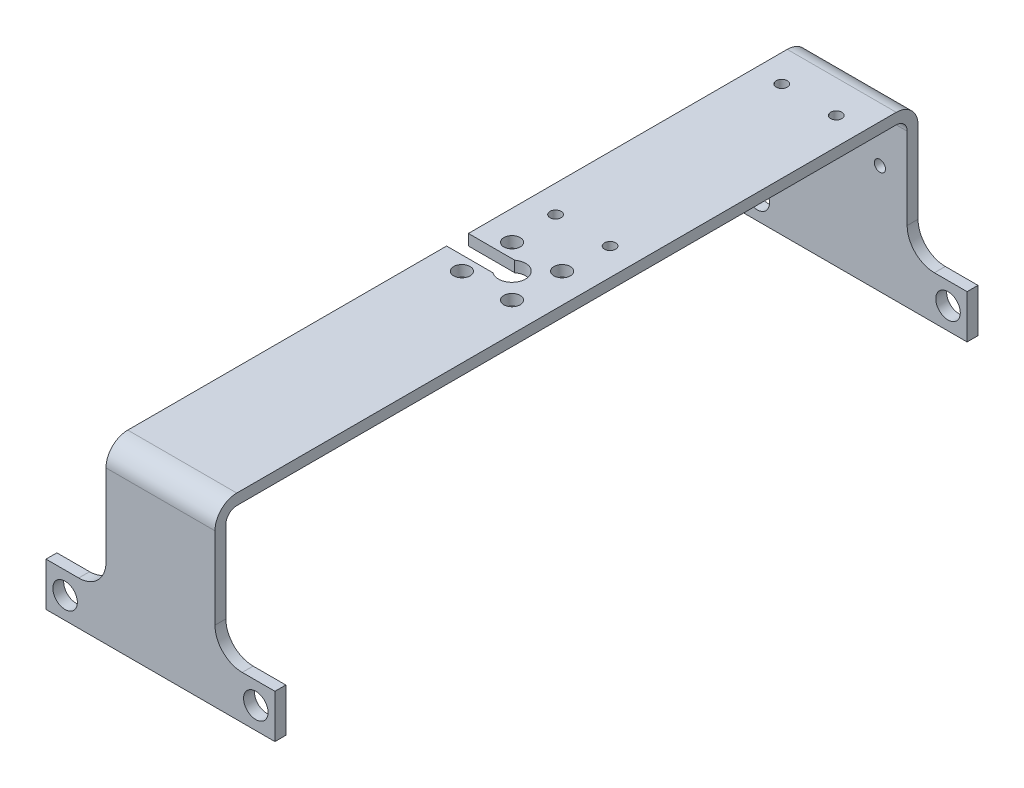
ISO-10303-21;
HEADER;
FILE_DESCRIPTION(('STEP AP214'),'2;1');
FILE_NAME('part.step','',(''),(''),'','','');
FILE_SCHEMA(('AUTOMOTIVE_DESIGN { 1 0 10303 214 1 1 1 1 }'));
ENDSEC;
DATA;
#1=APPLICATION_CONTEXT('core data for automotive mechanical design processes');
#2=APPLICATION_PROTOCOL_DEFINITION('international standard','automotive_design',2000,#1);
#3=PRODUCT_CONTEXT('',#1,'mechanical');
#4=PRODUCT('Part','Part','',(#3));
#5=PRODUCT_RELATED_PRODUCT_CATEGORY('part','',(#4));
#6=PRODUCT_DEFINITION_FORMATION('','',#4);
#7=PRODUCT_DEFINITION_CONTEXT('part definition',#1,'design');
#8=PRODUCT_DEFINITION('design','',#6,#7);
#9=PRODUCT_DEFINITION_SHAPE('','',#8);
#10=(LENGTH_UNIT() NAMED_UNIT(*) SI_UNIT(.MILLI.,.METRE.));
#11=(NAMED_UNIT(*) PLANE_ANGLE_UNIT() SI_UNIT($,.RADIAN.));
#12=(NAMED_UNIT(*) SI_UNIT($,.STERADIAN.) SOLID_ANGLE_UNIT());
#13=UNCERTAINTY_MEASURE_WITH_UNIT(LENGTH_MEASURE(1.E-05),#10,'distance_accuracy_value','');
#14=(GEOMETRIC_REPRESENTATION_CONTEXT(3) GLOBAL_UNCERTAINTY_ASSIGNED_CONTEXT((#13)) GLOBAL_UNIT_ASSIGNED_CONTEXT((#10,
#11,#12)) REPRESENTATION_CONTEXT('',''));
#15=CARTESIAN_POINT('',(0.,0.,0.));
#16=DIRECTION('',(0.,0.,1.));
#17=DIRECTION('',(1.,0.,0.));
#18=AXIS2_PLACEMENT_3D('',#15,#16,#17);
#19=CARTESIAN_POINT('',(20.,28.,3.99999999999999));
#20=DIRECTION('',(1.,0.,0.));
#21=DIRECTION('',(0.,0.,-1.));
#22=AXIS2_PLACEMENT_3D('',#19,#20,#21);
#23=PLANE('',#22);
#24=DIRECTION('',(0.,1.,0.));
#25=VECTOR('',#24,1.);
#26=CARTESIAN_POINT('',(20.,28.,129.));
#27=LINE('',#26,#25);
#28=CARTESIAN_POINT('',(20.,13.,129.));
#29=VERTEX_POINT('',#28);
#30=CARTESIAN_POINT('',(20.,28.,129.));
#31=VERTEX_POINT('',#30);
#32=EDGE_CURVE('E331',#29,#31,#27,.T.);
#33=ORIENTED_EDGE('',*,*,#32,.F.);
#34=DIRECTION('',(0.,0.,1.));
#35=VECTOR('',#34,1.);
#36=CARTESIAN_POINT('',(20.,13.,127.));
#37=LINE('',#36,#35);
#38=CARTESIAN_POINT('',(20.,13.,127.));
#39=VERTEX_POINT('',#38);
#40=EDGE_CURVE('E442',#29,#39,#37,.F.);
#41=ORIENTED_EDGE('',*,*,#40,.T.);
#42=DIRECTION('',(0.,-1.,0.));
#43=VECTOR('',#42,1.);
#44=CARTESIAN_POINT('',(20.,0.,127.));
#45=LINE('',#44,#43);
#46=CARTESIAN_POINT('',(20.,28.,127.));
#47=VERTEX_POINT('',#46);
#48=EDGE_CURVE('E235',#47,#39,#45,.T.);
#49=ORIENTED_EDGE('',*,*,#48,.F.);
#50=CARTESIAN_POINT('',(20.,28.,125.));
#51=DIRECTION('',(1.,0.,0.));
#52=DIRECTION('',(0.,0.,-1.));
#53=AXIS2_PLACEMENT_3D('',#50,#51,#52);
#54=CIRCLE('',#53,1.99999999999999);
#55=CARTESIAN_POINT('',(20.,30.,125.));
#56=VERTEX_POINT('',#55);
#57=EDGE_CURVE('E336',#56,#47,#54,.T.);
#58=ORIENTED_EDGE('',*,*,#57,.F.);
#59=DIRECTION('',(0.,0.,-1.));
#60=VECTOR('',#59,1.);
#61=CARTESIAN_POINT('',(20.,30.,71.5));
#62=LINE('',#61,#60);
#63=CARTESIAN_POINT('',(20.,30.,3.99999999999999));
#64=VERTEX_POINT('',#63);
#65=EDGE_CURVE('E414',#56,#64,#62,.T.);
#66=ORIENTED_EDGE('',*,*,#65,.T.);
#67=CARTESIAN_POINT('',(20.,28.,3.99999999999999));
#68=DIRECTION('',(-1.,0.,0.));
#69=DIRECTION('',(0.,0.,-1.));
#70=AXIS2_PLACEMENT_3D('',#67,#68,#69);
#71=CIRCLE('',#70,1.99999999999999);
#72=CARTESIAN_POINT('',(20.,28.,2.));
#73=VERTEX_POINT('',#72);
#74=EDGE_CURVE('E416',#64,#73,#71,.T.);
#75=ORIENTED_EDGE('',*,*,#74,.T.);
#76=DIRECTION('',(0.,-1.,0.));
#77=VECTOR('',#76,1.);
#78=CARTESIAN_POINT('',(20.,0.,2.));
#79=LINE('',#78,#77);
#80=CARTESIAN_POINT('',(20.,13.,2.));
#81=VERTEX_POINT('',#80);
#82=EDGE_CURVE('E419',#73,#81,#79,.T.);
#83=ORIENTED_EDGE('',*,*,#82,.T.);
#84=DIRECTION('',(0.,0.,-1.));
#85=VECTOR('',#84,1.);
#86=CARTESIAN_POINT('',(20.,13.,3.99999999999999));
#87=LINE('',#86,#85);
#88=CARTESIAN_POINT('',(20.,13.,0.));
#89=VERTEX_POINT('',#88);
#90=EDGE_CURVE('E474',#81,#89,#87,.T.);
#91=ORIENTED_EDGE('',*,*,#90,.T.);
#92=DIRECTION('',(0.,1.,0.));
#93=VECTOR('',#92,1.);
#94=CARTESIAN_POINT('',(20.,28.,0.));
#95=LINE('',#94,#93);
#96=CARTESIAN_POINT('',(20.,28.,0.));
#97=VERTEX_POINT('',#96);
#98=EDGE_CURVE('E428',#89,#97,#95,.T.);
#99=ORIENTED_EDGE('',*,*,#98,.T.);
#100=CARTESIAN_POINT('',(20.,28.,4.));
#101=DIRECTION('',(1.,0.,0.));
#102=DIRECTION('',(0.,0.,-1.));
#103=AXIS2_PLACEMENT_3D('',#100,#101,#102);
#104=CIRCLE('',#103,4.);
#105=CARTESIAN_POINT('',(20.,32.,4.));
#106=VERTEX_POINT('',#105);
#107=EDGE_CURVE('E484',#97,#106,#104,.T.);
#108=ORIENTED_EDGE('',*,*,#107,.T.);
#109=DIRECTION('',(0.,0.,1.));
#110=VECTOR('',#109,1.);
#111=CARTESIAN_POINT('',(20.,32.,4.));
#112=LINE('',#111,#110);
#113=CARTESIAN_POINT('',(20.,32.,125.));
#114=VERTEX_POINT('',#113);
#115=EDGE_CURVE('E515',#106,#114,#112,.T.);
#116=ORIENTED_EDGE('',*,*,#115,.T.);
#117=CARTESIAN_POINT('',(20.,28.,125.));
#118=DIRECTION('',(1.,0.,0.));
#119=DIRECTION('',(0.,0.,-1.));
#120=AXIS2_PLACEMENT_3D('',#117,#118,#119);
#121=CIRCLE('',#120,4.);
#122=EDGE_CURVE('E326',#31,#114,#121,.F.);
#123=ORIENTED_EDGE('',*,*,#122,.F.);
#124=EDGE_LOOP('',(#33,#41,#49,#58,#66,#75,#83,#91,#99,#108,#116,#123));
#125=FACE_BOUND('',#124,.T.);
#126=ADVANCED_FACE('F39',(#125),#23,.T.);
#127=CARTESIAN_POINT('',(0.,28.,3.99999999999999));
#128=DIRECTION('',(1.,0.,0.));
#129=DIRECTION('',(0.,0.,-1.));
#130=AXIS2_PLACEMENT_3D('',#127,#128,#129);
#131=PLANE('',#130);
#132=DIRECTION('',(0.,1.,0.));
#133=VECTOR('',#132,1.);
#134=CARTESIAN_POINT('',(0.,28.,0.));
#135=LINE('',#134,#133);
#136=CARTESIAN_POINT('',(0.,13.,0.));
#137=VERTEX_POINT('',#136);
#138=CARTESIAN_POINT('',(0.,28.,0.));
#139=VERTEX_POINT('',#138);
#140=EDGE_CURVE('E521',#137,#139,#135,.T.);
#141=ORIENTED_EDGE('',*,*,#140,.F.);
#142=DIRECTION('',(0.,0.,-1.));
#143=VECTOR('',#142,1.);
#144=CARTESIAN_POINT('',(0.,13.,2.));
#145=LINE('',#144,#143);
#146=CARTESIAN_POINT('',(0.,13.,2.));
#147=VERTEX_POINT('',#146);
#148=EDGE_CURVE('E60',#137,#147,#145,.F.);
#149=ORIENTED_EDGE('',*,*,#148,.T.);
#150=DIRECTION('',(0.,-1.,0.));
#151=VECTOR('',#150,1.);
#152=CARTESIAN_POINT('',(0.,0.,2.));
#153=LINE('',#152,#151);
#154=CARTESIAN_POINT('',(0.,28.,2.));
#155=VERTEX_POINT('',#154);
#156=EDGE_CURVE('E523',#155,#147,#153,.T.);
#157=ORIENTED_EDGE('',*,*,#156,.F.);
#158=CARTESIAN_POINT('',(0.,28.,3.99999999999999));
#159=DIRECTION('',(-1.,0.,0.));
#160=DIRECTION('',(0.,0.,-1.));
#161=AXIS2_PLACEMENT_3D('',#158,#159,#160);
#162=CIRCLE('',#161,1.99999999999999);
#163=CARTESIAN_POINT('',(0.,30.,3.99999999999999));
#164=VERTEX_POINT('',#163);
#165=EDGE_CURVE('E525',#164,#155,#162,.T.);
#166=ORIENTED_EDGE('',*,*,#165,.F.);
#167=DIRECTION('',(0.,0.,-1.));
#168=VECTOR('',#167,1.);
#169=CARTESIAN_POINT('',(0.,30.,71.5));
#170=LINE('',#169,#168);
#171=CARTESIAN_POINT('',(0.,30.,62.5));
#172=VERTEX_POINT('',#171);
#173=EDGE_CURVE('E413',#172,#164,#170,.T.);
#174=ORIENTED_EDGE('',*,*,#173,.F.);
#175=DIRECTION('',(0.,1.,0.));
#176=VECTOR('',#175,1.);
#177=CARTESIAN_POINT('',(0.,0.,62.5));
#178=LINE('',#177,#176);
#179=CARTESIAN_POINT('',(0.,32.,62.5));
#180=VERTEX_POINT('',#179);
#181=EDGE_CURVE('E303',#172,#180,#178,.T.);
#182=ORIENTED_EDGE('',*,*,#181,.T.);
#183=DIRECTION('',(0.,0.,1.));
#184=VECTOR('',#183,1.);
#185=CARTESIAN_POINT('',(0.,32.,4.));
#186=LINE('',#185,#184);
#187=CARTESIAN_POINT('',(0.,32.,4.));
#188=VERTEX_POINT('',#187);
#189=EDGE_CURVE('E417',#188,#180,#186,.T.);
#190=ORIENTED_EDGE('',*,*,#189,.F.);
#191=CARTESIAN_POINT('',(0.,28.,4.));
#192=DIRECTION('',(1.,0.,0.));
#193=DIRECTION('',(0.,0.,-1.));
#194=AXIS2_PLACEMENT_3D('',#191,#192,#193);
#195=CIRCLE('',#194,4.);
#196=EDGE_CURVE('E519',#139,#188,#195,.T.);
#197=ORIENTED_EDGE('',*,*,#196,.F.);
#198=EDGE_LOOP('',(#141,#149,#157,#166,#174,#182,#190,#197));
#199=FACE_BOUND('',#198,.T.);
#200=ADVANCED_FACE('F604',(#199),#131,.F.);
#201=DIRECTION('',(0.,-1.,0.));
#202=VECTOR('',#201,1.);
#203=CARTESIAN_POINT('',(0.,0.,127.));
#204=LINE('',#203,#202);
#205=CARTESIAN_POINT('',(0.,28.,127.));
#206=VERTEX_POINT('',#205);
#207=CARTESIAN_POINT('',(0.,13.,127.));
#208=VERTEX_POINT('',#207);
#209=EDGE_CURVE('E321',#206,#208,#204,.T.);
#210=ORIENTED_EDGE('',*,*,#209,.T.);
#211=DIRECTION('',(0.,0.,1.));
#212=VECTOR('',#211,1.);
#213=CARTESIAN_POINT('',(0.,13.,3.99999999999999));
#214=LINE('',#213,#212);
#215=CARTESIAN_POINT('',(0.,13.,129.));
#216=VERTEX_POINT('',#215);
#217=EDGE_CURVE('E437',#208,#216,#214,.T.);
#218=ORIENTED_EDGE('',*,*,#217,.T.);
#219=DIRECTION('',(0.,1.,0.));
#220=VECTOR('',#219,1.);
#221=CARTESIAN_POINT('',(0.,28.,129.));
#222=LINE('',#221,#220);
#223=CARTESIAN_POINT('',(0.,28.,129.));
#224=VERTEX_POINT('',#223);
#225=EDGE_CURVE('E319',#216,#224,#222,.T.);
#226=ORIENTED_EDGE('',*,*,#225,.T.);
#227=CARTESIAN_POINT('',(0.,28.,125.));
#228=DIRECTION('',(-1.,0.,0.));
#229=DIRECTION('',(0.,0.,1.));
#230=AXIS2_PLACEMENT_3D('',#227,#228,#229);
#231=CIRCLE('',#230,4.);
#232=CARTESIAN_POINT('',(0.,32.,125.));
#233=VERTEX_POINT('',#232);
#234=EDGE_CURVE('E315',#224,#233,#231,.T.);
#235=ORIENTED_EDGE('',*,*,#234,.T.);
#236=CARTESIAN_POINT('',(0.,32.,66.5));
#237=VERTEX_POINT('',#236);
#238=EDGE_CURVE('E518',#237,#233,#186,.T.);
#239=ORIENTED_EDGE('',*,*,#238,.F.);
#240=DIRECTION('',(0.,1.,0.));
#241=VECTOR('',#240,1.);
#242=CARTESIAN_POINT('',(0.,0.,66.5));
#243=LINE('',#242,#241);
#244=CARTESIAN_POINT('',(0.,30.,66.5));
#245=VERTEX_POINT('',#244);
#246=EDGE_CURVE('E304',#245,#237,#243,.T.);
#247=ORIENTED_EDGE('',*,*,#246,.F.);
#248=CARTESIAN_POINT('',(0.,30.,125.));
#249=VERTEX_POINT('',#248);
#250=EDGE_CURVE('E527',#249,#245,#170,.T.);
#251=ORIENTED_EDGE('',*,*,#250,.F.);
#252=CARTESIAN_POINT('',(0.,28.,125.));
#253=DIRECTION('',(1.,0.,0.));
#254=DIRECTION('',(0.,0.,1.));
#255=AXIS2_PLACEMENT_3D('',#252,#253,#254);
#256=CIRCLE('',#255,1.99999999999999);
#257=EDGE_CURVE('E314',#249,#206,#256,.T.);
#258=ORIENTED_EDGE('',*,*,#257,.T.);
#259=EDGE_LOOP('',(#210,#218,#226,#235,#239,#247,#251,#258));
#260=FACE_BOUND('',#259,.T.);
#261=ADVANCED_FACE('F609',(#260),#131,.F.);
#262=CARTESIAN_POINT('',(20.,30.,71.5));
#263=DIRECTION('',(0.,1.,0.));
#264=DIRECTION('',(0.,0.,1.));
#265=AXIS2_PLACEMENT_3D('',#262,#263,#264);
#266=PLANE('',#265);
#267=CARTESIAN_POINT('',(15.,30.,51.5));
#268=DIRECTION('',(0.,1.,0.));
#269=DIRECTION('',(0.,0.,1.));
#270=AXIS2_PLACEMENT_3D('',#267,#268,#269);
#271=CIRCLE('',#270,1.02499999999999);
#272=CARTESIAN_POINT('',(15.,30.,52.525));
#273=VERTEX_POINT('',#272);
#274=EDGE_CURVE('E362',#273,#273,#271,.T.);
#275=ORIENTED_EDGE('',*,*,#274,.T.);
#276=EDGE_LOOP('',(#275));
#277=FACE_BOUND('',#276,.T.);
#278=CARTESIAN_POINT('',(5.,30.,51.5));
#279=DIRECTION('',(0.,1.,0.));
#280=DIRECTION('',(0.,0.,1.));
#281=AXIS2_PLACEMENT_3D('',#278,#279,#280);
#282=CIRCLE('',#281,1.02499999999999);
#283=CARTESIAN_POINT('',(5.,30.,52.525));
#284=VERTEX_POINT('',#283);
#285=EDGE_CURVE('E368',#284,#284,#282,.T.);
#286=ORIENTED_EDGE('',*,*,#285,.T.);
#287=EDGE_LOOP('',(#286));
#288=FACE_BOUND('',#287,.T.);
#289=CARTESIAN_POINT('',(15.,30.,10.));
#290=DIRECTION('',(0.,1.,0.));
#291=DIRECTION('',(0.,0.,1.));
#292=AXIS2_PLACEMENT_3D('',#289,#290,#291);
#293=CIRCLE('',#292,1.02499999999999);
#294=CARTESIAN_POINT('',(15.,30.,11.025));
#295=VERTEX_POINT('',#294);
#296=EDGE_CURVE('E374',#295,#295,#293,.T.);
#297=ORIENTED_EDGE('',*,*,#296,.T.);
#298=EDGE_LOOP('',(#297));
#299=FACE_BOUND('',#298,.T.);
#300=CARTESIAN_POINT('',(4.99999999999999,30.,10.));
#301=DIRECTION('',(0.,1.,0.));
#302=DIRECTION('',(0.,0.,1.));
#303=AXIS2_PLACEMENT_3D('',#300,#301,#302);
#304=CIRCLE('',#303,1.02499999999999);
#305=CARTESIAN_POINT('',(4.99999999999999,30.,11.025));
#306=VERTEX_POINT('',#305);
#307=EDGE_CURVE('E380',#306,#306,#304,.T.);
#308=ORIENTED_EDGE('',*,*,#307,.T.);
#309=EDGE_LOOP('',(#308));
#310=FACE_BOUND('',#309,.T.);
#311=CARTESIAN_POINT('',(14.5961940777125,30.,59.9038059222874));
#312=DIRECTION('',(0.,1.,0.));
#313=DIRECTION('',(0.,0.,1.));
#314=AXIS2_PLACEMENT_3D('',#311,#312,#313);
#315=CIRCLE('',#314,1.49999999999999);
#316=CARTESIAN_POINT('',(14.5961940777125,30.,61.4038059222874));
#317=VERTEX_POINT('',#316);
#318=EDGE_CURVE('E386',#317,#317,#315,.T.);
#319=ORIENTED_EDGE('',*,*,#318,.T.);
#320=EDGE_LOOP('',(#319));
#321=FACE_BOUND('',#320,.T.);
#322=CARTESIAN_POINT('',(14.5961940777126,30.,69.0961940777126));
#323=DIRECTION('',(0.,1.,0.));
#324=DIRECTION('',(0.,0.,1.));
#325=AXIS2_PLACEMENT_3D('',#322,#323,#324);
#326=CIRCLE('',#325,1.49999999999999);
#327=CARTESIAN_POINT('',(14.5961940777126,30.,70.5961940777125));
#328=VERTEX_POINT('',#327);
#329=EDGE_CURVE('E392',#328,#328,#326,.T.);
#330=ORIENTED_EDGE('',*,*,#329,.T.);
#331=EDGE_LOOP('',(#330));
#332=FACE_BOUND('',#331,.T.);
#333=CARTESIAN_POINT('',(5.40380592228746,30.,69.0961940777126));
#334=DIRECTION('',(0.,1.,0.));
#335=DIRECTION('',(0.,0.,1.));
#336=AXIS2_PLACEMENT_3D('',#333,#334,#335);
#337=CIRCLE('',#336,1.49999999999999);
#338=CARTESIAN_POINT('',(5.40380592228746,30.,70.5961940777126));
#339=VERTEX_POINT('',#338);
#340=EDGE_CURVE('E398',#339,#339,#337,.T.);
#341=ORIENTED_EDGE('',*,*,#340,.T.);
#342=EDGE_LOOP('',(#341));
#343=FACE_BOUND('',#342,.T.);
#344=CARTESIAN_POINT('',(5.40380592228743,30.,59.9038059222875));
#345=DIRECTION('',(0.,1.,0.));
#346=DIRECTION('',(0.,0.,1.));
#347=AXIS2_PLACEMENT_3D('',#344,#345,#346);
#348=CIRCLE('',#347,1.49999999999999);
#349=CARTESIAN_POINT('',(5.40380592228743,30.,61.4038059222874));
#350=VERTEX_POINT('',#349);
#351=EDGE_CURVE('E404',#350,#350,#348,.T.);
#352=ORIENTED_EDGE('',*,*,#351,.T.);
#353=EDGE_LOOP('',(#352));
#354=FACE_BOUND('',#353,.T.);
#355=ORIENTED_EDGE('',*,*,#250,.T.);
#356=DIRECTION('',(1.,0.,0.));
#357=VECTOR('',#356,1.);
#358=CARTESIAN_POINT('',(20.,30.,66.5));
#359=LINE('',#358,#357);
#360=CARTESIAN_POINT('',(8.5,30.,66.5));
#361=VERTEX_POINT('',#360);
#362=EDGE_CURVE('E311',#245,#361,#359,.T.);
#363=ORIENTED_EDGE('',*,*,#362,.T.);
#364=CARTESIAN_POINT('',(10.,30.,64.5));
#365=DIRECTION('',(0.,1.,0.));
#366=DIRECTION('',(0.,0.,1.));
#367=AXIS2_PLACEMENT_3D('',#364,#365,#366);
#368=CIRCLE('',#367,2.5);
#369=CARTESIAN_POINT('',(8.5,30.,62.5));
#370=VERTEX_POINT('',#369);
#371=EDGE_CURVE('E410',#361,#370,#368,.T.);
#372=ORIENTED_EDGE('',*,*,#371,.T.);
#373=DIRECTION('',(-1.,0.,0.));
#374=VECTOR('',#373,1.);
#375=CARTESIAN_POINT('',(20.,30.,62.5));
#376=LINE('',#375,#374);
#377=EDGE_CURVE('E306',#370,#172,#376,.T.);
#378=ORIENTED_EDGE('',*,*,#377,.T.);
#379=ORIENTED_EDGE('',*,*,#173,.T.);
#380=DIRECTION('',(-1.,0.,0.));
#381=VECTOR('',#380,1.);
#382=CARTESIAN_POINT('',(20.,30.,3.99999999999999));
#383=LINE('',#382,#381);
#384=EDGE_CURVE('E499',#64,#164,#383,.T.);
#385=ORIENTED_EDGE('',*,*,#384,.F.);
#386=ORIENTED_EDGE('',*,*,#65,.F.);
#387=DIRECTION('',(-1.,0.,0.));
#388=VECTOR('',#387,1.);
#389=CARTESIAN_POINT('',(85.8046350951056,30.,125.));
#390=LINE('',#389,#388);
#391=EDGE_CURVE('E318',#56,#249,#390,.T.);
#392=ORIENTED_EDGE('',*,*,#391,.T.);
#393=EDGE_LOOP('',(#355,#363,#372,#378,#379,#385,#386,#392));
#394=FACE_BOUND('',#393,.T.);
#395=ADVANCED_FACE('F634',(#277,#288,#299,#310,#321,#332,#343,#354,#394),#266,.F.);
#396=CARTESIAN_POINT('',(20.,28.,3.99999999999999));
#397=DIRECTION('',(-1.,0.,0.));
#398=DIRECTION('',(0.,0.,1.));
#399=AXIS2_PLACEMENT_3D('',#396,#397,#398);
#400=CYLINDRICAL_SURFACE('',#399,1.99999999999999);
#401=ORIENTED_EDGE('',*,*,#165,.T.);
#402=DIRECTION('',(-1.,0.,0.));
#403=VECTOR('',#402,1.);
#404=CARTESIAN_POINT('',(20.,28.,2.));
#405=LINE('',#404,#403);
#406=EDGE_CURVE('E501',#73,#155,#405,.T.);
#407=ORIENTED_EDGE('',*,*,#406,.F.);
#408=ORIENTED_EDGE('',*,*,#74,.F.);
#409=ORIENTED_EDGE('',*,*,#384,.T.);
#410=EDGE_LOOP('',(#401,#407,#408,#409));
#411=FACE_BOUND('',#410,.T.);
#412=ADVANCED_FACE('F630',(#411),#400,.F.);
#413=CARTESIAN_POINT('',(20.,0.,2.));
#414=DIRECTION('',(0.,0.,-1.));
#415=DIRECTION('',(0.,1.,0.));
#416=AXIS2_PLACEMENT_3D('',#413,#414,#415);
#417=PLANE('',#416);
#418=CARTESIAN_POINT('',(-7.5,4.,2.));
#419=DIRECTION('',(0.,0.,-1.));
#420=DIRECTION('',(0.,1.,0.));
#421=AXIS2_PLACEMENT_3D('',#418,#419,#420);
#422=CIRCLE('',#421,2.25);
#423=CARTESIAN_POINT('',(-7.5,6.25,2.));
#424=VERTEX_POINT('',#423);
#425=EDGE_CURVE('E570',#424,#424,#422,.T.);
#426=ORIENTED_EDGE('',*,*,#425,.T.);
#427=EDGE_LOOP('',(#426));
#428=FACE_BOUND('',#427,.T.);
#429=CARTESIAN_POINT('',(27.5,4.,2.));
#430=DIRECTION('',(0.,0.,-1.));
#431=DIRECTION('',(0.,1.,0.));
#432=AXIS2_PLACEMENT_3D('',#429,#430,#431);
#433=CIRCLE('',#432,2.25);
#434=CARTESIAN_POINT('',(27.5,6.25,2.));
#435=VERTEX_POINT('',#434);
#436=EDGE_CURVE('E559',#435,#435,#433,.T.);
#437=ORIENTED_EDGE('',*,*,#436,.T.);
#438=EDGE_LOOP('',(#437));
#439=FACE_BOUND('',#438,.T.);
#440=CARTESIAN_POINT('',(15.,20.,2.));
#441=DIRECTION('',(0.,0.,-1.));
#442=DIRECTION('',(0.,1.,0.));
#443=AXIS2_PLACEMENT_3D('',#440,#441,#442);
#444=CIRCLE('',#443,1.02499999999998);
#445=CARTESIAN_POINT('',(15.,21.025,2.));
#446=VERTEX_POINT('',#445);
#447=EDGE_CURVE('E350',#446,#446,#444,.T.);
#448=ORIENTED_EDGE('',*,*,#447,.T.);
#449=EDGE_LOOP('',(#448));
#450=FACE_BOUND('',#449,.T.);
#451=CARTESIAN_POINT('',(5.,20.,2.));
#452=DIRECTION('',(0.,0.,-1.));
#453=DIRECTION('',(0.,1.,0.));
#454=AXIS2_PLACEMENT_3D('',#451,#452,#453);
#455=CIRCLE('',#454,1.02499999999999);
#456=CARTESIAN_POINT('',(5.,21.025,2.));
#457=VERTEX_POINT('',#456);
#458=EDGE_CURVE('E356',#457,#457,#455,.T.);
#459=ORIENTED_EDGE('',*,*,#458,.T.);
#460=EDGE_LOOP('',(#459));
#461=FACE_BOUND('',#460,.T.);
#462=ORIENTED_EDGE('',*,*,#156,.T.);
#463=CARTESIAN_POINT('',(-5.,13.,2.));
#464=DIRECTION('',(0.,0.,-1.));
#465=DIRECTION('',(0.,1.,0.));
#466=AXIS2_PLACEMENT_3D('',#463,#464,#465);
#467=CIRCLE('',#466,5.);
#468=CARTESIAN_POINT('',(-5.,8.,2.));
#469=VERTEX_POINT('',#468);
#470=EDGE_CURVE('E11',#147,#469,#467,.T.);
#471=ORIENTED_EDGE('',*,*,#470,.T.);
#472=DIRECTION('',(1.,0.,0.));
#473=VECTOR('',#472,1.);
#474=CARTESIAN_POINT('',(0.,8.,2.));
#475=LINE('',#474,#473);
#476=CARTESIAN_POINT('',(-11.,8.,2.));
#477=VERTEX_POINT('',#476);
#478=EDGE_CURVE('E286',#477,#469,#475,.T.);
#479=ORIENTED_EDGE('',*,*,#478,.F.);
#480=DIRECTION('',(0.,1.,0.));
#481=VECTOR('',#480,1.);
#482=CARTESIAN_POINT('',(-11.,0.,2.));
#483=LINE('',#482,#481);
#484=CARTESIAN_POINT('',(-11.,0.,2.));
#485=VERTEX_POINT('',#484);
#486=EDGE_CURVE('E283',#485,#477,#483,.T.);
#487=ORIENTED_EDGE('',*,*,#486,.F.);
#488=DIRECTION('',(-1.,0.,0.));
#489=VECTOR('',#488,1.);
#490=CARTESIAN_POINT('',(20.,0.,2.));
#491=LINE('',#490,#489);
#492=CARTESIAN_POINT('',(31.,0.,2.));
#493=VERTEX_POINT('',#492);
#494=EDGE_CURVE('E505',#493,#485,#491,.T.);
#495=ORIENTED_EDGE('',*,*,#494,.F.);
#496=DIRECTION('',(0.,-1.,0.));
#497=VECTOR('',#496,1.);
#498=CARTESIAN_POINT('',(31.,0.,2.));
#499=LINE('',#498,#497);
#500=CARTESIAN_POINT('',(31.,8.,2.));
#501=VERTEX_POINT('',#500);
#502=EDGE_CURVE('E270',#501,#493,#499,.T.);
#503=ORIENTED_EDGE('',*,*,#502,.F.);
#504=DIRECTION('',(1.,0.,0.));
#505=VECTOR('',#504,1.);
#506=CARTESIAN_POINT('',(20.,8.,2.));
#507=LINE('',#506,#505);
#508=CARTESIAN_POINT('',(25.,8.,2.));
#509=VERTEX_POINT('',#508);
#510=EDGE_CURVE('E274',#509,#501,#507,.T.);
#511=ORIENTED_EDGE('',*,*,#510,.F.);
#512=CARTESIAN_POINT('',(25.,13.,2.));
#513=DIRECTION('',(0.,0.,-1.));
#514=DIRECTION('',(0.,1.,0.));
#515=AXIS2_PLACEMENT_3D('',#512,#513,#514);
#516=CIRCLE('',#515,5.);
#517=EDGE_CURVE('E460',#509,#81,#516,.T.);
#518=ORIENTED_EDGE('',*,*,#517,.T.);
#519=ORIENTED_EDGE('',*,*,#82,.F.);
#520=ORIENTED_EDGE('',*,*,#406,.T.);
#521=EDGE_LOOP('',(#462,#471,#479,#487,#495,#503,#511,#518,#519,#520));
#522=FACE_BOUND('',#521,.T.);
#523=ADVANCED_FACE('F465',(#428,#439,#450,#461,#522),#417,.F.);
#524=CARTESIAN_POINT('',(20.,0.,2.));
#525=DIRECTION('',(0.,1.,0.));
#526=DIRECTION('',(0.,0.,1.));
#527=AXIS2_PLACEMENT_3D('',#524,#525,#526);
#528=PLANE('',#527);
#529=ORIENTED_EDGE('',*,*,#494,.T.);
#530=DIRECTION('',(0.,0.,-1.));
#531=VECTOR('',#530,1.);
#532=CARTESIAN_POINT('',(-11.,0.,15.6014705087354));
#533=LINE('',#532,#531);
#534=CARTESIAN_POINT('',(-11.,0.,0.));
#535=VERTEX_POINT('',#534);
#536=EDGE_CURVE('E295',#485,#535,#533,.T.);
#537=ORIENTED_EDGE('',*,*,#536,.T.);
#538=DIRECTION('',(-1.,0.,0.));
#539=VECTOR('',#538,1.);
#540=CARTESIAN_POINT('',(20.,0.,0.));
#541=LINE('',#540,#539);
#542=CARTESIAN_POINT('',(31.,0.,0.));
#543=VERTEX_POINT('',#542);
#544=EDGE_CURVE('E507',#543,#535,#541,.T.);
#545=ORIENTED_EDGE('',*,*,#544,.F.);
#546=DIRECTION('',(0.,0.,-1.));
#547=VECTOR('',#546,1.);
#548=CARTESIAN_POINT('',(31.,0.,15.6014705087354));
#549=LINE('',#548,#547);
#550=EDGE_CURVE('E280',#493,#543,#549,.T.);
#551=ORIENTED_EDGE('',*,*,#550,.F.);
#552=EDGE_LOOP('',(#529,#537,#545,#551));
#553=FACE_BOUND('',#552,.T.);
#554=ADVANCED_FACE('F623',(#553),#528,.F.);
#555=CARTESIAN_POINT('',(20.,28.,0.));
#556=DIRECTION('',(0.,0.,1.));
#557=DIRECTION('',(1.,0.,0.));
#558=AXIS2_PLACEMENT_3D('',#555,#556,#557);
#559=PLANE('',#558);
#560=CARTESIAN_POINT('',(-7.5,4.,0.));
#561=DIRECTION('',(0.,0.,-1.));
#562=DIRECTION('',(1.,0.,0.));
#563=AXIS2_PLACEMENT_3D('',#560,#561,#562);
#564=CIRCLE('',#563,2.25);
#565=CARTESIAN_POINT('',(-5.25,4.,0.));
#566=VERTEX_POINT('',#565);
#567=EDGE_CURVE('E579',#566,#566,#564,.T.);
#568=ORIENTED_EDGE('',*,*,#567,.F.);
#569=EDGE_LOOP('',(#568));
#570=FACE_BOUND('',#569,.T.);
#571=CARTESIAN_POINT('',(27.5,4.,0.));
#572=DIRECTION('',(0.,0.,-1.));
#573=DIRECTION('',(-1.,0.,0.));
#574=AXIS2_PLACEMENT_3D('',#571,#572,#573);
#575=CIRCLE('',#574,2.25);
#576=CARTESIAN_POINT('',(25.25,4.,0.));
#577=VERTEX_POINT('',#576);
#578=EDGE_CURVE('E567',#577,#577,#575,.T.);
#579=ORIENTED_EDGE('',*,*,#578,.F.);
#580=EDGE_LOOP('',(#579));
#581=FACE_BOUND('',#580,.T.);
#582=CARTESIAN_POINT('',(15.,20.,0.));
#583=DIRECTION('',(0.,0.,-1.));
#584=DIRECTION('',(0.,1.,0.));
#585=AXIS2_PLACEMENT_3D('',#582,#583,#584);
#586=CIRCLE('',#585,1.02499999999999);
#587=CARTESIAN_POINT('',(15.,21.025,0.));
#588=VERTEX_POINT('',#587);
#589=EDGE_CURVE('E341',#588,#588,#586,.T.);
#590=ORIENTED_EDGE('',*,*,#589,.F.);
#591=EDGE_LOOP('',(#590));
#592=FACE_BOUND('',#591,.T.);
#593=CARTESIAN_POINT('',(5.,20.,0.));
#594=DIRECTION('',(0.,0.,-1.));
#595=DIRECTION('',(0.,1.,0.));
#596=AXIS2_PLACEMENT_3D('',#593,#594,#595);
#597=CIRCLE('',#596,1.02499999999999);
#598=CARTESIAN_POINT('',(5.,21.025,0.));
#599=VERTEX_POINT('',#598);
#600=EDGE_CURVE('E353',#599,#599,#597,.T.);
#601=ORIENTED_EDGE('',*,*,#600,.F.);
#602=EDGE_LOOP('',(#601));
#603=FACE_BOUND('',#602,.T.);
#604=ORIENTED_EDGE('',*,*,#544,.T.);
#605=DIRECTION('',(0.,-1.,0.));
#606=VECTOR('',#605,1.);
#607=CARTESIAN_POINT('',(-11.,0.,0.));
#608=LINE('',#607,#606);
#609=CARTESIAN_POINT('',(-11.,8.,0.));
#610=VERTEX_POINT('',#609);
#611=EDGE_CURVE('E292',#610,#535,#608,.T.);
#612=ORIENTED_EDGE('',*,*,#611,.F.);
#613=DIRECTION('',(-1.,0.,0.));
#614=VECTOR('',#613,1.);
#615=CARTESIAN_POINT('',(0.,8.,0.));
#616=LINE('',#615,#614);
#617=CARTESIAN_POINT('',(-5.,8.,0.));
#618=VERTEX_POINT('',#617);
#619=EDGE_CURVE('E273',#618,#610,#616,.T.);
#620=ORIENTED_EDGE('',*,*,#619,.F.);
#621=CARTESIAN_POINT('',(-5.,13.,0.));
#622=DIRECTION('',(0.,0.,1.));
#623=DIRECTION('',(1.,0.,0.));
#624=AXIS2_PLACEMENT_3D('',#621,#622,#623);
#625=CIRCLE('',#624,5.);
#626=EDGE_CURVE('E47',#618,#137,#625,.T.);
#627=ORIENTED_EDGE('',*,*,#626,.T.);
#628=ORIENTED_EDGE('',*,*,#140,.T.);
#629=DIRECTION('',(-1.,0.,0.));
#630=VECTOR('',#629,1.);
#631=CARTESIAN_POINT('',(20.,28.,0.));
#632=LINE('',#631,#630);
#633=EDGE_CURVE('E509',#97,#139,#632,.T.);
#634=ORIENTED_EDGE('',*,*,#633,.F.);
#635=ORIENTED_EDGE('',*,*,#98,.F.);
#636=CARTESIAN_POINT('',(25.,13.,0.));
#637=DIRECTION('',(0.,0.,1.));
#638=DIRECTION('',(1.,0.,0.));
#639=AXIS2_PLACEMENT_3D('',#636,#637,#638);
#640=CIRCLE('',#639,5.);
#641=CARTESIAN_POINT('',(25.,8.,0.));
#642=VERTEX_POINT('',#641);
#643=EDGE_CURVE('E458',#89,#642,#640,.T.);
#644=ORIENTED_EDGE('',*,*,#643,.T.);
#645=DIRECTION('',(-1.,0.,0.));
#646=VECTOR('',#645,1.);
#647=CARTESIAN_POINT('',(20.,8.,0.));
#648=LINE('',#647,#646);
#649=CARTESIAN_POINT('',(31.,8.,0.));
#650=VERTEX_POINT('',#649);
#651=EDGE_CURVE('E277',#650,#642,#648,.T.);
#652=ORIENTED_EDGE('',*,*,#651,.F.);
#653=DIRECTION('',(0.,1.,0.));
#654=VECTOR('',#653,1.);
#655=CARTESIAN_POINT('',(31.,0.,0.));
#656=LINE('',#655,#654);
#657=EDGE_CURVE('E267',#543,#650,#656,.T.);
#658=ORIENTED_EDGE('',*,*,#657,.F.);
#659=EDGE_LOOP('',(#604,#612,#620,#627,#628,#634,#635,#644,#652,#658));
#660=FACE_BOUND('',#659,.T.);
#661=ADVANCED_FACE('F620',(#570,#581,#592,#603,#660),#559,.F.);
#662=CARTESIAN_POINT('',(20.,28.,4.));
#663=DIRECTION('',(-1.,0.,0.));
#664=DIRECTION('',(0.,0.,1.));
#665=AXIS2_PLACEMENT_3D('',#662,#663,#664);
#666=CYLINDRICAL_SURFACE('',#665,4.);
#667=ORIENTED_EDGE('',*,*,#196,.T.);
#668=DIRECTION('',(-1.,0.,0.));
#669=VECTOR('',#668,1.);
#670=CARTESIAN_POINT('',(20.,32.,4.));
#671=LINE('',#670,#669);
#672=EDGE_CURVE('E512',#106,#188,#671,.T.);
#673=ORIENTED_EDGE('',*,*,#672,.F.);
#674=ORIENTED_EDGE('',*,*,#107,.F.);
#675=ORIENTED_EDGE('',*,*,#633,.T.);
#676=EDGE_LOOP('',(#667,#673,#674,#675));
#677=FACE_BOUND('',#676,.T.);
#678=ADVANCED_FACE('F537',(#677),#666,.T.);
#679=CARTESIAN_POINT('',(20.,32.,4.));
#680=DIRECTION('',(0.,-1.,0.));
#681=DIRECTION('',(0.,0.,-1.));
#682=AXIS2_PLACEMENT_3D('',#679,#680,#681);
#683=PLANE('',#682);
#684=CARTESIAN_POINT('',(15.,32.,51.5));
#685=DIRECTION('',(0.,1.,0.));
#686=DIRECTION('',(0.,0.,1.));
#687=AXIS2_PLACEMENT_3D('',#684,#685,#686);
#688=CIRCLE('',#687,1.02499999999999);
#689=CARTESIAN_POINT('',(15.,32.,52.525));
#690=VERTEX_POINT('',#689);
#691=EDGE_CURVE('E359',#690,#690,#688,.T.);
#692=ORIENTED_EDGE('',*,*,#691,.F.);
#693=EDGE_LOOP('',(#692));
#694=FACE_BOUND('',#693,.T.);
#695=CARTESIAN_POINT('',(5.,32.,51.5));
#696=DIRECTION('',(0.,1.,0.));
#697=DIRECTION('',(0.,0.,1.));
#698=AXIS2_PLACEMENT_3D('',#695,#696,#697);
#699=CIRCLE('',#698,1.02499999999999);
#700=CARTESIAN_POINT('',(5.,32.,52.525));
#701=VERTEX_POINT('',#700);
#702=EDGE_CURVE('E365',#701,#701,#699,.T.);
#703=ORIENTED_EDGE('',*,*,#702,.F.);
#704=EDGE_LOOP('',(#703));
#705=FACE_BOUND('',#704,.T.);
#706=CARTESIAN_POINT('',(15.,32.,10.));
#707=DIRECTION('',(0.,1.,0.));
#708=DIRECTION('',(0.,0.,1.));
#709=AXIS2_PLACEMENT_3D('',#706,#707,#708);
#710=CIRCLE('',#709,1.02499999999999);
#711=CARTESIAN_POINT('',(15.,32.,11.025));
#712=VERTEX_POINT('',#711);
#713=EDGE_CURVE('E371',#712,#712,#710,.T.);
#714=ORIENTED_EDGE('',*,*,#713,.F.);
#715=EDGE_LOOP('',(#714));
#716=FACE_BOUND('',#715,.T.);
#717=CARTESIAN_POINT('',(4.99999999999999,32.,10.));
#718=DIRECTION('',(0.,1.,0.));
#719=DIRECTION('',(0.,0.,1.));
#720=AXIS2_PLACEMENT_3D('',#717,#718,#719);
#721=CIRCLE('',#720,1.02499999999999);
#722=CARTESIAN_POINT('',(4.99999999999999,32.,11.025));
#723=VERTEX_POINT('',#722);
#724=EDGE_CURVE('E377',#723,#723,#721,.T.);
#725=ORIENTED_EDGE('',*,*,#724,.F.);
#726=EDGE_LOOP('',(#725));
#727=FACE_BOUND('',#726,.T.);
#728=CARTESIAN_POINT('',(14.5961940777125,32.,59.9038059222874));
#729=DIRECTION('',(0.,1.,0.));
#730=DIRECTION('',(0.,0.,1.));
#731=AXIS2_PLACEMENT_3D('',#728,#729,#730);
#732=CIRCLE('',#731,1.49999999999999);
#733=CARTESIAN_POINT('',(14.5961940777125,32.,61.4038059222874));
#734=VERTEX_POINT('',#733);
#735=EDGE_CURVE('E383',#734,#734,#732,.T.);
#736=ORIENTED_EDGE('',*,*,#735,.F.);
#737=EDGE_LOOP('',(#736));
#738=FACE_BOUND('',#737,.T.);
#739=CARTESIAN_POINT('',(14.5961940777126,32.,69.0961940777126));
#740=DIRECTION('',(0.,1.,0.));
#741=DIRECTION('',(0.,0.,1.));
#742=AXIS2_PLACEMENT_3D('',#739,#740,#741);
#743=CIRCLE('',#742,1.49999999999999);
#744=CARTESIAN_POINT('',(14.5961940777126,32.,70.5961940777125));
#745=VERTEX_POINT('',#744);
#746=EDGE_CURVE('E389',#745,#745,#743,.T.);
#747=ORIENTED_EDGE('',*,*,#746,.F.);
#748=EDGE_LOOP('',(#747));
#749=FACE_BOUND('',#748,.T.);
#750=CARTESIAN_POINT('',(5.40380592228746,32.,69.0961940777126));
#751=DIRECTION('',(0.,1.,0.));
#752=DIRECTION('',(0.,0.,1.));
#753=AXIS2_PLACEMENT_3D('',#750,#751,#752);
#754=CIRCLE('',#753,1.49999999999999);
#755=CARTESIAN_POINT('',(5.40380592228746,32.,70.5961940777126));
#756=VERTEX_POINT('',#755);
#757=EDGE_CURVE('E395',#756,#756,#754,.T.);
#758=ORIENTED_EDGE('',*,*,#757,.F.);
#759=EDGE_LOOP('',(#758));
#760=FACE_BOUND('',#759,.T.);
#761=CARTESIAN_POINT('',(5.40380592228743,32.,59.9038059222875));
#762=DIRECTION('',(0.,1.,0.));
#763=DIRECTION('',(0.,0.,1.));
#764=AXIS2_PLACEMENT_3D('',#761,#762,#763);
#765=CIRCLE('',#764,1.49999999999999);
#766=CARTESIAN_POINT('',(5.40380592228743,32.,61.4038059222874));
#767=VERTEX_POINT('',#766);
#768=EDGE_CURVE('E401',#767,#767,#765,.T.);
#769=ORIENTED_EDGE('',*,*,#768,.F.);
#770=EDGE_LOOP('',(#769));
#771=FACE_BOUND('',#770,.T.);
#772=CARTESIAN_POINT('',(10.,32.,64.5));
#773=DIRECTION('',(0.,1.,0.));
#774=DIRECTION('',(0.,0.,1.));
#775=AXIS2_PLACEMENT_3D('',#772,#773,#774);
#776=CIRCLE('',#775,2.5);
#777=CARTESIAN_POINT('',(8.5,32.,66.5));
#778=VERTEX_POINT('',#777);
#779=CARTESIAN_POINT('',(8.5,32.,62.5));
#780=VERTEX_POINT('',#779);
#781=EDGE_CURVE('E407',#778,#780,#776,.T.);
#782=ORIENTED_EDGE('',*,*,#781,.F.);
#783=DIRECTION('',(1.,0.,0.));
#784=VECTOR('',#783,1.);
#785=CARTESIAN_POINT('',(8.5,32.,66.5));
#786=LINE('',#785,#784);
#787=EDGE_CURVE('E301',#237,#778,#786,.T.);
#788=ORIENTED_EDGE('',*,*,#787,.F.);
#789=ORIENTED_EDGE('',*,*,#238,.T.);
#790=DIRECTION('',(-1.,0.,0.));
#791=VECTOR('',#790,1.);
#792=CARTESIAN_POINT('',(85.8046350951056,32.,125.));
#793=LINE('',#792,#791);
#794=EDGE_CURVE('E329',#114,#233,#793,.T.);
#795=ORIENTED_EDGE('',*,*,#794,.F.);
#796=ORIENTED_EDGE('',*,*,#115,.F.);
#797=ORIENTED_EDGE('',*,*,#672,.T.);
#798=ORIENTED_EDGE('',*,*,#189,.T.);
#799=DIRECTION('',(-1.,0.,0.));
#800=VECTOR('',#799,1.);
#801=CARTESIAN_POINT('',(8.5,32.,62.5));
#802=LINE('',#801,#800);
#803=EDGE_CURVE('E290',#780,#180,#802,.T.);
#804=ORIENTED_EDGE('',*,*,#803,.F.);
#805=EDGE_LOOP('',(#782,#788,#789,#795,#796,#797,#798,#804));
#806=FACE_BOUND('',#805,.T.);
#807=ADVANCED_FACE('F541',(#694,#705,#716,#727,#738,#749,#760,#771,#806),#683,.F.);
#808=CARTESIAN_POINT('',(10.,0.,64.5));
#809=DIRECTION('',(0.,1.,0.));
#810=DIRECTION('',(0.,0.,1.));
#811=AXIS2_PLACEMENT_3D('',#808,#809,#810);
#812=CYLINDRICAL_SURFACE('',#811,2.5);
#813=ORIENTED_EDGE('',*,*,#371,.F.);
#814=DIRECTION('',(0.,1.,0.));
#815=VECTOR('',#814,1.);
#816=CARTESIAN_POINT('',(8.5,0.,66.5));
#817=LINE('',#816,#815);
#818=EDGE_CURVE('E429',#361,#778,#817,.T.);
#819=ORIENTED_EDGE('',*,*,#818,.T.);
#820=ORIENTED_EDGE('',*,*,#781,.T.);
#821=DIRECTION('',(0.,1.,0.));
#822=VECTOR('',#821,1.);
#823=CARTESIAN_POINT('',(8.5,0.,62.5));
#824=LINE('',#823,#822);
#825=EDGE_CURVE('E494',#780,#370,#824,.F.);
#826=ORIENTED_EDGE('',*,*,#825,.T.);
#827=EDGE_LOOP('',(#813,#819,#820,#826));
#828=FACE_BOUND('',#827,.T.);
#829=ADVANCED_FACE('F612',(#828),#812,.F.);
#830=CARTESIAN_POINT('',(5.40380592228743,32.,59.9038059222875));
#831=DIRECTION('',(0.,1.,0.));
#832=DIRECTION('',(0.,0.,1.));
#833=AXIS2_PLACEMENT_3D('',#830,#831,#832);
#834=CYLINDRICAL_SURFACE('',#833,1.49999999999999);
#835=ORIENTED_EDGE('',*,*,#768,.T.);
#836=EDGE_LOOP('',(#835));
#837=FACE_BOUND('',#836,.T.);
#838=ORIENTED_EDGE('',*,*,#351,.F.);
#839=EDGE_LOOP('',(#838));
#840=FACE_BOUND('',#839,.T.);
#841=ADVANCED_FACE('F672',(#837,#840),#834,.F.);
#842=CARTESIAN_POINT('',(5.40380592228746,32.,69.0961940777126));
#843=DIRECTION('',(0.,1.,0.));
#844=DIRECTION('',(0.,0.,1.));
#845=AXIS2_PLACEMENT_3D('',#842,#843,#844);
#846=CYLINDRICAL_SURFACE('',#845,1.49999999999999);
#847=ORIENTED_EDGE('',*,*,#757,.T.);
#848=EDGE_LOOP('',(#847));
#849=FACE_BOUND('',#848,.T.);
#850=ORIENTED_EDGE('',*,*,#340,.F.);
#851=EDGE_LOOP('',(#850));
#852=FACE_BOUND('',#851,.T.);
#853=ADVANCED_FACE('F676',(#849,#852),#846,.F.);
#854=CARTESIAN_POINT('',(14.5961940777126,32.,69.0961940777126));
#855=DIRECTION('',(0.,1.,0.));
#856=DIRECTION('',(0.,0.,1.));
#857=AXIS2_PLACEMENT_3D('',#854,#855,#856);
#858=CYLINDRICAL_SURFACE('',#857,1.49999999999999);
#859=ORIENTED_EDGE('',*,*,#746,.T.);
#860=EDGE_LOOP('',(#859));
#861=FACE_BOUND('',#860,.T.);
#862=ORIENTED_EDGE('',*,*,#329,.F.);
#863=EDGE_LOOP('',(#862));
#864=FACE_BOUND('',#863,.T.);
#865=ADVANCED_FACE('F681',(#861,#864),#858,.F.);
#866=CARTESIAN_POINT('',(14.5961940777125,32.,59.9038059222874));
#867=DIRECTION('',(0.,1.,0.));
#868=DIRECTION('',(0.,0.,1.));
#869=AXIS2_PLACEMENT_3D('',#866,#867,#868);
#870=CYLINDRICAL_SURFACE('',#869,1.49999999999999);
#871=ORIENTED_EDGE('',*,*,#735,.T.);
#872=EDGE_LOOP('',(#871));
#873=FACE_BOUND('',#872,.T.);
#874=ORIENTED_EDGE('',*,*,#318,.F.);
#875=EDGE_LOOP('',(#874));
#876=FACE_BOUND('',#875,.T.);
#877=ADVANCED_FACE('F688',(#873,#876),#870,.F.);
#878=CARTESIAN_POINT('',(4.99999999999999,32.,10.));
#879=DIRECTION('',(0.,1.,0.));
#880=DIRECTION('',(0.,0.,1.));
#881=AXIS2_PLACEMENT_3D('',#878,#879,#880);
#882=CYLINDRICAL_SURFACE('',#881,1.02499999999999);
#883=ORIENTED_EDGE('',*,*,#307,.F.);
#884=EDGE_LOOP('',(#883));
#885=FACE_BOUND('',#884,.T.);
#886=ORIENTED_EDGE('',*,*,#724,.T.);
#887=EDGE_LOOP('',(#886));
#888=FACE_BOUND('',#887,.T.);
#889=ADVANCED_FACE('F692',(#885,#888),#882,.F.);
#890=CARTESIAN_POINT('',(15.,32.,10.));
#891=DIRECTION('',(0.,1.,0.));
#892=DIRECTION('',(0.,0.,1.));
#893=AXIS2_PLACEMENT_3D('',#890,#891,#892);
#894=CYLINDRICAL_SURFACE('',#893,1.02499999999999);
#895=ORIENTED_EDGE('',*,*,#296,.F.);
#896=EDGE_LOOP('',(#895));
#897=FACE_BOUND('',#896,.T.);
#898=ORIENTED_EDGE('',*,*,#713,.T.);
#899=EDGE_LOOP('',(#898));
#900=FACE_BOUND('',#899,.T.);
#901=ADVANCED_FACE('F696',(#897,#900),#894,.F.);
#902=CARTESIAN_POINT('',(5.,32.,51.5));
#903=DIRECTION('',(0.,1.,0.));
#904=DIRECTION('',(0.,0.,1.));
#905=AXIS2_PLACEMENT_3D('',#902,#903,#904);
#906=CYLINDRICAL_SURFACE('',#905,1.02499999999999);
#907=ORIENTED_EDGE('',*,*,#285,.F.);
#908=EDGE_LOOP('',(#907));
#909=FACE_BOUND('',#908,.T.);
#910=ORIENTED_EDGE('',*,*,#702,.T.);
#911=EDGE_LOOP('',(#910));
#912=FACE_BOUND('',#911,.T.);
#913=ADVANCED_FACE('F700',(#909,#912),#906,.F.);
#914=CARTESIAN_POINT('',(15.,32.,51.5));
#915=DIRECTION('',(0.,1.,0.));
#916=DIRECTION('',(0.,0.,1.));
#917=AXIS2_PLACEMENT_3D('',#914,#915,#916);
#918=CYLINDRICAL_SURFACE('',#917,1.02499999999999);
#919=ORIENTED_EDGE('',*,*,#274,.F.);
#920=EDGE_LOOP('',(#919));
#921=FACE_BOUND('',#920,.T.);
#922=ORIENTED_EDGE('',*,*,#691,.T.);
#923=EDGE_LOOP('',(#922));
#924=FACE_BOUND('',#923,.T.);
#925=ADVANCED_FACE('F704',(#921,#924),#918,.F.);
#926=CARTESIAN_POINT('',(5.,20.,0.));
#927=DIRECTION('',(0.,0.,-1.));
#928=DIRECTION('',(0.,1.,0.));
#929=AXIS2_PLACEMENT_3D('',#926,#927,#928);
#930=CYLINDRICAL_SURFACE('',#929,1.02499999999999);
#931=ORIENTED_EDGE('',*,*,#600,.T.);
#932=EDGE_LOOP('',(#931));
#933=FACE_BOUND('',#932,.T.);
#934=ORIENTED_EDGE('',*,*,#458,.F.);
#935=EDGE_LOOP('',(#934));
#936=FACE_BOUND('',#935,.T.);
#937=ADVANCED_FACE('F708',(#933,#936),#930,.F.);
#938=CARTESIAN_POINT('',(15.,20.,0.));
#939=DIRECTION('',(0.,0.,-1.));
#940=DIRECTION('',(0.,1.,0.));
#941=AXIS2_PLACEMENT_3D('',#938,#939,#940);
#942=CYLINDRICAL_SURFACE('',#941,1.02499999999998);
#943=ORIENTED_EDGE('',*,*,#589,.T.);
#944=EDGE_LOOP('',(#943));
#945=FACE_BOUND('',#944,.T.);
#946=ORIENTED_EDGE('',*,*,#447,.F.);
#947=EDGE_LOOP('',(#946));
#948=FACE_BOUND('',#947,.T.);
#949=ADVANCED_FACE('F712',(#945,#948),#942,.F.);
#950=CARTESIAN_POINT('',(85.8046350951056,28.,125.));
#951=DIRECTION('',(-1.,0.,0.));
#952=DIRECTION('',(0.,0.,1.));
#953=AXIS2_PLACEMENT_3D('',#950,#951,#952);
#954=CYLINDRICAL_SURFACE('',#953,1.99999999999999);
#955=ORIENTED_EDGE('',*,*,#391,.F.);
#956=ORIENTED_EDGE('',*,*,#57,.T.);
#957=DIRECTION('',(-1.,0.,0.));
#958=VECTOR('',#957,1.);
#959=CARTESIAN_POINT('',(85.8046350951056,28.,127.));
#960=LINE('',#959,#958);
#961=EDGE_CURVE('E335',#47,#206,#960,.T.);
#962=ORIENTED_EDGE('',*,*,#961,.T.);
#963=ORIENTED_EDGE('',*,*,#257,.F.);
#964=EDGE_LOOP('',(#955,#956,#962,#963));
#965=FACE_BOUND('',#964,.T.);
#966=ADVANCED_FACE('F716',(#965),#954,.F.);
#967=CARTESIAN_POINT('',(85.8046350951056,0.,127.));
#968=DIRECTION('',(0.,0.,-1.));
#969=DIRECTION('',(0.,1.,0.));
#970=AXIS2_PLACEMENT_3D('',#967,#968,#969);
#971=PLANE('',#970);
#972=CARTESIAN_POINT('',(-7.5,4.,127.));
#973=DIRECTION('',(0.,0.,-1.));
#974=DIRECTION('',(0.,1.,0.));
#975=AXIS2_PLACEMENT_3D('',#972,#973,#974);
#976=CIRCLE('',#975,2.25);
#977=CARTESIAN_POINT('',(-7.5,6.25,127.));
#978=VERTEX_POINT('',#977);
#979=EDGE_CURVE('E575',#978,#978,#976,.T.);
#980=ORIENTED_EDGE('',*,*,#979,.F.);
#981=EDGE_LOOP('',(#980));
#982=FACE_BOUND('',#981,.T.);
#983=CARTESIAN_POINT('',(27.5,4.,127.));
#984=DIRECTION('',(0.,0.,-1.));
#985=DIRECTION('',(0.,1.,0.));
#986=AXIS2_PLACEMENT_3D('',#983,#984,#985);
#987=CIRCLE('',#986,2.25);
#988=CARTESIAN_POINT('',(27.5,6.25,127.));
#989=VERTEX_POINT('',#988);
#990=EDGE_CURVE('E563',#989,#989,#987,.T.);
#991=ORIENTED_EDGE('',*,*,#990,.F.);
#992=EDGE_LOOP('',(#991));
#993=FACE_BOUND('',#992,.T.);
#994=ORIENTED_EDGE('',*,*,#961,.F.);
#995=ORIENTED_EDGE('',*,*,#48,.T.);
#996=CARTESIAN_POINT('',(25.,13.,127.));
#997=DIRECTION('',(0.,0.,-1.));
#998=DIRECTION('',(0.,1.,0.));
#999=AXIS2_PLACEMENT_3D('',#996,#997,#998);
#1000=CIRCLE('',#999,5.);
#1001=CARTESIAN_POINT('',(25.,8.,127.));
#1002=VERTEX_POINT('',#1001);
#1003=EDGE_CURVE('E456',#39,#1002,#1000,.F.);
#1004=ORIENTED_EDGE('',*,*,#1003,.T.);
#1005=DIRECTION('',(-1.,0.,0.));
#1006=VECTOR('',#1005,1.);
#1007=CARTESIAN_POINT('',(20.,8.,127.));
#1008=LINE('',#1007,#1006);
#1009=CARTESIAN_POINT('',(31.,8.,127.));
#1010=VERTEX_POINT('',#1009);
#1011=EDGE_CURVE('E242',#1010,#1002,#1008,.T.);
#1012=ORIENTED_EDGE('',*,*,#1011,.F.);
#1013=DIRECTION('',(0.,1.,0.));
#1014=VECTOR('',#1013,1.);
#1015=CARTESIAN_POINT('',(31.,8.00000000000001,127.));
#1016=LINE('',#1015,#1014);
#1017=CARTESIAN_POINT('',(31.,0.,127.));
#1018=VERTEX_POINT('',#1017);
#1019=EDGE_CURVE('E238',#1018,#1010,#1016,.T.);
#1020=ORIENTED_EDGE('',*,*,#1019,.F.);
#1021=DIRECTION('',(-1.,0.,0.));
#1022=VECTOR('',#1021,1.);
#1023=CARTESIAN_POINT('',(85.8046350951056,0.,127.));
#1024=LINE('',#1023,#1022);
#1025=CARTESIAN_POINT('',(-11.,0.,127.));
#1026=VERTEX_POINT('',#1025);
#1027=EDGE_CURVE('E223',#1018,#1026,#1024,.T.);
#1028=ORIENTED_EDGE('',*,*,#1027,.T.);
#1029=DIRECTION('',(0.,-1.,0.));
#1030=VECTOR('',#1029,1.);
#1031=CARTESIAN_POINT('',(-11.,8.00000000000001,127.));
#1032=LINE('',#1031,#1030);
#1033=CARTESIAN_POINT('',(-11.,8.,127.));
#1034=VERTEX_POINT('',#1033);
#1035=EDGE_CURVE('E264',#1034,#1026,#1032,.T.);
#1036=ORIENTED_EDGE('',*,*,#1035,.F.);
#1037=DIRECTION('',(-1.,0.,0.));
#1038=VECTOR('',#1037,1.);
#1039=CARTESIAN_POINT('',(0.,8.,127.));
#1040=LINE('',#1039,#1038);
#1041=CARTESIAN_POINT('',(-5.,8.,127.));
#1042=VERTEX_POINT('',#1041);
#1043=EDGE_CURVE('E259',#1042,#1034,#1040,.T.);
#1044=ORIENTED_EDGE('',*,*,#1043,.F.);
#1045=CARTESIAN_POINT('',(-5.,13.,127.));
#1046=DIRECTION('',(0.,0.,-1.));
#1047=DIRECTION('',(0.,1.,0.));
#1048=AXIS2_PLACEMENT_3D('',#1045,#1046,#1047);
#1049=CIRCLE('',#1048,5.);
#1050=EDGE_CURVE('E452',#1042,#208,#1049,.F.);
#1051=ORIENTED_EDGE('',*,*,#1050,.T.);
#1052=ORIENTED_EDGE('',*,*,#209,.F.);
#1053=EDGE_LOOP('',(#994,#995,#1004,#1012,#1020,#1028,#1036,#1044,#1051,#1052));
#1054=FACE_BOUND('',#1053,.T.);
#1055=ADVANCED_FACE('F240',(#982,#993,#1054),#971,.T.);
#1056=CARTESIAN_POINT('',(85.8046350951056,0.,129.));
#1057=DIRECTION('',(0.,-1.,0.));
#1058=DIRECTION('',(0.,0.,-1.));
#1059=AXIS2_PLACEMENT_3D('',#1056,#1057,#1058);
#1060=PLANE('',#1059);
#1061=ORIENTED_EDGE('',*,*,#1027,.F.);
#1062=DIRECTION('',(0.,0.,1.));
#1063=VECTOR('',#1062,1.);
#1064=CARTESIAN_POINT('',(31.,0.,113.398529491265));
#1065=LINE('',#1064,#1063);
#1066=CARTESIAN_POINT('',(31.,0.,129.));
#1067=VERTEX_POINT('',#1066);
#1068=EDGE_CURVE('E227',#1018,#1067,#1065,.T.);
#1069=ORIENTED_EDGE('',*,*,#1068,.T.);
#1070=DIRECTION('',(-1.,0.,0.));
#1071=VECTOR('',#1070,1.);
#1072=CARTESIAN_POINT('',(85.8046350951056,0.,129.));
#1073=LINE('',#1072,#1071);
#1074=CARTESIAN_POINT('',(-11.,0.,129.));
#1075=VERTEX_POINT('',#1074);
#1076=EDGE_CURVE('E234',#1067,#1075,#1073,.T.);
#1077=ORIENTED_EDGE('',*,*,#1076,.T.);
#1078=DIRECTION('',(0.,0.,1.));
#1079=VECTOR('',#1078,1.);
#1080=CARTESIAN_POINT('',(-11.,0.,113.398529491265));
#1081=LINE('',#1080,#1079);
#1082=EDGE_CURVE('E230',#1026,#1075,#1081,.T.);
#1083=ORIENTED_EDGE('',*,*,#1082,.F.);
#1084=EDGE_LOOP('',(#1061,#1069,#1077,#1083));
#1085=FACE_BOUND('',#1084,.T.);
#1086=ADVANCED_FACE('F225',(#1085),#1060,.T.);
#1087=CARTESIAN_POINT('',(85.8046350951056,28.,129.));
#1088=DIRECTION('',(0.,0.,1.));
#1089=DIRECTION('',(1.,0.,0.));
#1090=AXIS2_PLACEMENT_3D('',#1087,#1088,#1089);
#1091=PLANE('',#1090);
#1092=CARTESIAN_POINT('',(-7.5,4.,129.));
#1093=DIRECTION('',(0.,0.,-1.));
#1094=DIRECTION('',(1.,0.,0.));
#1095=AXIS2_PLACEMENT_3D('',#1092,#1093,#1094);
#1096=CIRCLE('',#1095,2.25);
#1097=CARTESIAN_POINT('',(-5.25,4.,129.));
#1098=VERTEX_POINT('',#1097);
#1099=EDGE_CURVE('E578',#1098,#1098,#1096,.T.);
#1100=ORIENTED_EDGE('',*,*,#1099,.T.);
#1101=EDGE_LOOP('',(#1100));
#1102=FACE_BOUND('',#1101,.T.);
#1103=CARTESIAN_POINT('',(27.5,4.,129.));
#1104=DIRECTION('',(0.,0.,-1.));
#1105=DIRECTION('',(-1.,0.,0.));
#1106=AXIS2_PLACEMENT_3D('',#1103,#1104,#1105);
#1107=CIRCLE('',#1106,2.25);
#1108=CARTESIAN_POINT('',(25.25,4.,129.));
#1109=VERTEX_POINT('',#1108);
#1110=EDGE_CURVE('E566',#1109,#1109,#1107,.T.);
#1111=ORIENTED_EDGE('',*,*,#1110,.T.);
#1112=EDGE_LOOP('',(#1111));
#1113=FACE_BOUND('',#1112,.T.);
#1114=ORIENTED_EDGE('',*,*,#1076,.F.);
#1115=DIRECTION('',(0.,1.,0.));
#1116=VECTOR('',#1115,1.);
#1117=CARTESIAN_POINT('',(31.,8.,129.));
#1118=LINE('',#1117,#1116);
#1119=CARTESIAN_POINT('',(31.,8.,129.));
#1120=VERTEX_POINT('',#1119);
#1121=EDGE_CURVE('E249',#1067,#1120,#1118,.T.);
#1122=ORIENTED_EDGE('',*,*,#1121,.T.);
#1123=DIRECTION('',(-1.,0.,0.));
#1124=VECTOR('',#1123,1.);
#1125=CARTESIAN_POINT('',(20.,8.,129.));
#1126=LINE('',#1125,#1124);
#1127=CARTESIAN_POINT('',(25.,8.,129.));
#1128=VERTEX_POINT('',#1127);
#1129=EDGE_CURVE('E250',#1120,#1128,#1126,.T.);
#1130=ORIENTED_EDGE('',*,*,#1129,.T.);
#1131=CARTESIAN_POINT('',(25.,13.,129.));
#1132=DIRECTION('',(0.,0.,1.));
#1133=DIRECTION('',(1.,0.,0.));
#1134=AXIS2_PLACEMENT_3D('',#1131,#1132,#1133);
#1135=CIRCLE('',#1134,5.);
#1136=EDGE_CURVE('E454',#1128,#29,#1135,.F.);
#1137=ORIENTED_EDGE('',*,*,#1136,.T.);
#1138=ORIENTED_EDGE('',*,*,#32,.T.);
#1139=DIRECTION('',(-1.,0.,0.));
#1140=VECTOR('',#1139,1.);
#1141=CARTESIAN_POINT('',(85.8046350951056,28.,129.));
#1142=LINE('',#1141,#1140);
#1143=EDGE_CURVE('E330',#31,#224,#1142,.T.);
#1144=ORIENTED_EDGE('',*,*,#1143,.T.);
#1145=ORIENTED_EDGE('',*,*,#225,.F.);
#1146=CARTESIAN_POINT('',(-5.,13.,129.));
#1147=DIRECTION('',(0.,0.,1.));
#1148=DIRECTION('',(1.,0.,0.));
#1149=AXIS2_PLACEMENT_3D('',#1146,#1147,#1148);
#1150=CIRCLE('',#1149,5.);
#1151=CARTESIAN_POINT('',(-5.,8.,129.));
#1152=VERTEX_POINT('',#1151);
#1153=EDGE_CURVE('E450',#216,#1152,#1150,.F.);
#1154=ORIENTED_EDGE('',*,*,#1153,.T.);
#1155=DIRECTION('',(-1.,0.,0.));
#1156=VECTOR('',#1155,1.);
#1157=CARTESIAN_POINT('',(0.,8.,129.));
#1158=LINE('',#1157,#1156);
#1159=CARTESIAN_POINT('',(-11.,8.,129.));
#1160=VERTEX_POINT('',#1159);
#1161=EDGE_CURVE('E260',#1152,#1160,#1158,.T.);
#1162=ORIENTED_EDGE('',*,*,#1161,.T.);
#1163=DIRECTION('',(0.,-1.,0.));
#1164=VECTOR('',#1163,1.);
#1165=CARTESIAN_POINT('',(-11.,8.,129.));
#1166=LINE('',#1165,#1164);
#1167=EDGE_CURVE('E256',#1160,#1075,#1166,.T.);
#1168=ORIENTED_EDGE('',*,*,#1167,.T.);
#1169=EDGE_LOOP('',(#1114,#1122,#1130,#1137,#1138,#1144,#1145,#1154,#1162,#1168));
#1170=FACE_BOUND('',#1169,.T.);
#1171=ADVANCED_FACE('F585',(#1102,#1113,#1170),#1091,.T.);
#1172=CARTESIAN_POINT('',(85.8046350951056,28.,125.));
#1173=DIRECTION('',(-1.,0.,0.));
#1174=DIRECTION('',(0.,0.,1.));
#1175=AXIS2_PLACEMENT_3D('',#1172,#1173,#1174);
#1176=CYLINDRICAL_SURFACE('',#1175,4.);
#1177=ORIENTED_EDGE('',*,*,#1143,.F.);
#1178=ORIENTED_EDGE('',*,*,#122,.T.);
#1179=ORIENTED_EDGE('',*,*,#794,.T.);
#1180=ORIENTED_EDGE('',*,*,#234,.F.);
#1181=EDGE_LOOP('',(#1177,#1178,#1179,#1180));
#1182=FACE_BOUND('',#1181,.T.);
#1183=ADVANCED_FACE('F547',(#1182),#1176,.T.);
#1184=CARTESIAN_POINT('',(8.5,0.,62.5));
#1185=DIRECTION('',(0.,0.,-1.));
#1186=DIRECTION('',(0.,1.,0.));
#1187=AXIS2_PLACEMENT_3D('',#1184,#1185,#1186);
#1188=PLANE('',#1187);
#1189=ORIENTED_EDGE('',*,*,#825,.F.);
#1190=ORIENTED_EDGE('',*,*,#803,.T.);
#1191=ORIENTED_EDGE('',*,*,#181,.F.);
#1192=ORIENTED_EDGE('',*,*,#377,.F.);
#1193=EDGE_LOOP('',(#1189,#1190,#1191,#1192));
#1194=FACE_BOUND('',#1193,.T.);
#1195=ADVANCED_FACE('F730',(#1194),#1188,.F.);
#1196=CARTESIAN_POINT('',(8.5,0.,66.5));
#1197=DIRECTION('',(0.,0.,1.));
#1198=DIRECTION('',(0.,-1.,0.));
#1199=AXIS2_PLACEMENT_3D('',#1196,#1197,#1198);
#1200=PLANE('',#1199);
#1201=ORIENTED_EDGE('',*,*,#246,.T.);
#1202=ORIENTED_EDGE('',*,*,#787,.T.);
#1203=ORIENTED_EDGE('',*,*,#818,.F.);
#1204=ORIENTED_EDGE('',*,*,#362,.F.);
#1205=EDGE_LOOP('',(#1201,#1202,#1203,#1204));
#1206=FACE_BOUND('',#1205,.T.);
#1207=ADVANCED_FACE('F733',(#1206),#1200,.F.);
#1208=CARTESIAN_POINT('',(-11.,0.,15.6014705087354));
#1209=DIRECTION('',(1.,0.,0.));
#1210=DIRECTION('',(0.,0.,-1.));
#1211=AXIS2_PLACEMENT_3D('',#1208,#1209,#1210);
#1212=PLANE('',#1211);
#1213=ORIENTED_EDGE('',*,*,#536,.F.);
#1214=ORIENTED_EDGE('',*,*,#486,.T.);
#1215=DIRECTION('',(0.,0.,-1.));
#1216=VECTOR('',#1215,1.);
#1217=CARTESIAN_POINT('',(-11.,8.,15.6014705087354));
#1218=LINE('',#1217,#1216);
#1219=EDGE_CURVE('E287',#477,#610,#1218,.T.);
#1220=ORIENTED_EDGE('',*,*,#1219,.T.);
#1221=ORIENTED_EDGE('',*,*,#611,.T.);
#1222=EDGE_LOOP('',(#1213,#1214,#1220,#1221));
#1223=FACE_BOUND('',#1222,.T.);
#1224=ADVANCED_FACE('F659',(#1223),#1212,.F.);
#1225=CARTESIAN_POINT('',(0.,8.,15.6014705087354));
#1226=DIRECTION('',(0.,-1.,0.));
#1227=DIRECTION('',(0.,0.,-1.));
#1228=AXIS2_PLACEMENT_3D('',#1225,#1226,#1227);
#1229=PLANE('',#1228);
#1230=ORIENTED_EDGE('',*,*,#478,.T.);
#1231=DIRECTION('',(0.,0.,-1.));
#1232=VECTOR('',#1231,1.);
#1233=CARTESIAN_POINT('',(-5.,8.,0.));
#1234=LINE('',#1233,#1232);
#1235=EDGE_CURVE('E446',#469,#618,#1234,.T.);
#1236=ORIENTED_EDGE('',*,*,#1235,.T.);
#1237=ORIENTED_EDGE('',*,*,#619,.T.);
#1238=ORIENTED_EDGE('',*,*,#1219,.F.);
#1239=EDGE_LOOP('',(#1230,#1236,#1237,#1238));
#1240=FACE_BOUND('',#1239,.T.);
#1241=ADVANCED_FACE('F655',(#1240),#1229,.F.);
#1242=CARTESIAN_POINT('',(20.,8.,15.6014705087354));
#1243=DIRECTION('',(0.,-1.,0.));
#1244=DIRECTION('',(1.,0.,0.));
#1245=AXIS2_PLACEMENT_3D('',#1242,#1243,#1244);
#1246=PLANE('',#1245);
#1247=ORIENTED_EDGE('',*,*,#651,.T.);
#1248=DIRECTION('',(0.,0.,-1.));
#1249=VECTOR('',#1248,1.);
#1250=CARTESIAN_POINT('',(25.,8.,15.6014705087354));
#1251=LINE('',#1250,#1249);
#1252=EDGE_CURVE('E444',#642,#509,#1251,.F.);
#1253=ORIENTED_EDGE('',*,*,#1252,.T.);
#1254=ORIENTED_EDGE('',*,*,#510,.T.);
#1255=DIRECTION('',(0.,0.,-1.));
#1256=VECTOR('',#1255,1.);
#1257=CARTESIAN_POINT('',(31.,8.,15.6014705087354));
#1258=LINE('',#1257,#1256);
#1259=EDGE_CURVE('E278',#501,#650,#1258,.T.);
#1260=ORIENTED_EDGE('',*,*,#1259,.T.);
#1261=EDGE_LOOP('',(#1247,#1253,#1254,#1260));
#1262=FACE_BOUND('',#1261,.T.);
#1263=ADVANCED_FACE('F667',(#1262),#1246,.F.);
#1264=CARTESIAN_POINT('',(31.,0.,15.6014705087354));
#1265=DIRECTION('',(-1.,0.,0.));
#1266=DIRECTION('',(0.,0.,1.));
#1267=AXIS2_PLACEMENT_3D('',#1264,#1265,#1266);
#1268=PLANE('',#1267);
#1269=ORIENTED_EDGE('',*,*,#1259,.F.);
#1270=ORIENTED_EDGE('',*,*,#502,.T.);
#1271=ORIENTED_EDGE('',*,*,#550,.T.);
#1272=ORIENTED_EDGE('',*,*,#657,.T.);
#1273=EDGE_LOOP('',(#1269,#1270,#1271,#1272));
#1274=FACE_BOUND('',#1273,.T.);
#1275=ADVANCED_FACE('F664',(#1274),#1268,.F.);
#1276=CARTESIAN_POINT('',(0.,8.,113.398529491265));
#1277=DIRECTION('',(0.,1.,0.));
#1278=DIRECTION('',(0.,0.,1.));
#1279=AXIS2_PLACEMENT_3D('',#1276,#1277,#1278);
#1280=PLANE('',#1279);
#1281=ORIENTED_EDGE('',*,*,#1161,.F.);
#1282=DIRECTION('',(0.,0.,1.));
#1283=VECTOR('',#1282,1.);
#1284=CARTESIAN_POINT('',(-5.,8.,113.398529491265));
#1285=LINE('',#1284,#1283);
#1286=EDGE_CURVE('E481',#1152,#1042,#1285,.F.);
#1287=ORIENTED_EDGE('',*,*,#1286,.T.);
#1288=ORIENTED_EDGE('',*,*,#1043,.T.);
#1289=DIRECTION('',(0.,0.,1.));
#1290=VECTOR('',#1289,1.);
#1291=CARTESIAN_POINT('',(-11.,8.,113.398529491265));
#1292=LINE('',#1291,#1290);
#1293=EDGE_CURVE('E263',#1034,#1160,#1292,.T.);
#1294=ORIENTED_EDGE('',*,*,#1293,.T.);
#1295=EDGE_LOOP('',(#1281,#1287,#1288,#1294));
#1296=FACE_BOUND('',#1295,.T.);
#1297=ADVANCED_FACE('F743',(#1296),#1280,.T.);
#1298=CARTESIAN_POINT('',(-11.,8.,113.398529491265));
#1299=DIRECTION('',(-1.,0.,0.));
#1300=DIRECTION('',(0.,0.,1.));
#1301=AXIS2_PLACEMENT_3D('',#1298,#1299,#1300);
#1302=PLANE('',#1301);
#1303=ORIENTED_EDGE('',*,*,#1293,.F.);
#1304=ORIENTED_EDGE('',*,*,#1035,.T.);
#1305=ORIENTED_EDGE('',*,*,#1082,.T.);
#1306=ORIENTED_EDGE('',*,*,#1167,.F.);
#1307=EDGE_LOOP('',(#1303,#1304,#1305,#1306));
#1308=FACE_BOUND('',#1307,.T.);
#1309=ADVANCED_FACE('F748',(#1308),#1302,.T.);
#1310=CARTESIAN_POINT('',(31.,8.,113.398529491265));
#1311=DIRECTION('',(1.,0.,0.));
#1312=DIRECTION('',(0.,0.,-1.));
#1313=AXIS2_PLACEMENT_3D('',#1310,#1311,#1312);
#1314=PLANE('',#1313);
#1315=ORIENTED_EDGE('',*,*,#1068,.F.);
#1316=ORIENTED_EDGE('',*,*,#1019,.T.);
#1317=DIRECTION('',(0.,0.,1.));
#1318=VECTOR('',#1317,1.);
#1319=CARTESIAN_POINT('',(31.,8.,113.398529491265));
#1320=LINE('',#1319,#1318);
#1321=EDGE_CURVE('E245',#1010,#1120,#1320,.T.);
#1322=ORIENTED_EDGE('',*,*,#1321,.T.);
#1323=ORIENTED_EDGE('',*,*,#1121,.F.);
#1324=EDGE_LOOP('',(#1315,#1316,#1322,#1323));
#1325=FACE_BOUND('',#1324,.T.);
#1326=ADVANCED_FACE('F247',(#1325),#1314,.T.);
#1327=CARTESIAN_POINT('',(20.,8.,113.398529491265));
#1328=DIRECTION('',(0.,1.,0.));
#1329=DIRECTION('',(-1.,0.,0.));
#1330=AXIS2_PLACEMENT_3D('',#1327,#1328,#1329);
#1331=PLANE('',#1330);
#1332=ORIENTED_EDGE('',*,*,#1011,.T.);
#1333=DIRECTION('',(0.,0.,1.));
#1334=VECTOR('',#1333,1.);
#1335=CARTESIAN_POINT('',(25.,8.,129.));
#1336=LINE('',#1335,#1334);
#1337=EDGE_CURVE('E479',#1002,#1128,#1336,.T.);
#1338=ORIENTED_EDGE('',*,*,#1337,.T.);
#1339=ORIENTED_EDGE('',*,*,#1129,.F.);
#1340=ORIENTED_EDGE('',*,*,#1321,.F.);
#1341=EDGE_LOOP('',(#1332,#1338,#1339,#1340));
#1342=FACE_BOUND('',#1341,.T.);
#1343=ADVANCED_FACE('F555',(#1342),#1331,.T.);
#1344=CARTESIAN_POINT('',(27.5,4.,129.));
#1345=DIRECTION('',(0.,0.,-1.));
#1346=DIRECTION('',(-1.,0.,0.));
#1347=AXIS2_PLACEMENT_3D('',#1344,#1345,#1346);
#1348=CYLINDRICAL_SURFACE('',#1347,2.25);
#1349=ORIENTED_EDGE('',*,*,#990,.T.);
#1350=EDGE_LOOP('',(#1349));
#1351=FACE_BOUND('',#1350,.T.);
#1352=ORIENTED_EDGE('',*,*,#1110,.F.);
#1353=EDGE_LOOP('',(#1352));
#1354=FACE_BOUND('',#1353,.T.);
#1355=ADVANCED_FACE('F600',(#1351,#1354),#1348,.F.);
#1356=ORIENTED_EDGE('',*,*,#578,.T.);
#1357=EDGE_LOOP('',(#1356));
#1358=FACE_BOUND('',#1357,.T.);
#1359=ORIENTED_EDGE('',*,*,#436,.F.);
#1360=EDGE_LOOP('',(#1359));
#1361=FACE_BOUND('',#1360,.T.);
#1362=ADVANCED_FACE('F591',(#1358,#1361),#1348,.F.);
#1363=CARTESIAN_POINT('',(-7.5,4.,129.));
#1364=DIRECTION('',(0.,0.,-1.));
#1365=DIRECTION('',(-1.,0.,0.));
#1366=AXIS2_PLACEMENT_3D('',#1363,#1364,#1365);
#1367=CYLINDRICAL_SURFACE('',#1366,2.25);
#1368=ORIENTED_EDGE('',*,*,#979,.T.);
#1369=EDGE_LOOP('',(#1368));
#1370=FACE_BOUND('',#1369,.T.);
#1371=ORIENTED_EDGE('',*,*,#1099,.F.);
#1372=EDGE_LOOP('',(#1371));
#1373=FACE_BOUND('',#1372,.T.);
#1374=ADVANCED_FACE('F588',(#1370,#1373),#1367,.F.);
#1375=ORIENTED_EDGE('',*,*,#567,.T.);
#1376=EDGE_LOOP('',(#1375));
#1377=FACE_BOUND('',#1376,.T.);
#1378=ORIENTED_EDGE('',*,*,#425,.F.);
#1379=EDGE_LOOP('',(#1378));
#1380=FACE_BOUND('',#1379,.T.);
#1381=ADVANCED_FACE('F590',(#1377,#1380),#1367,.F.);
#1382=CARTESIAN_POINT('',(-5.,13.,3.99999999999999));
#1383=DIRECTION('',(0.,0.,1.));
#1384=DIRECTION('',(1.,0.,0.));
#1385=AXIS2_PLACEMENT_3D('',#1382,#1383,#1384);
#1386=CYLINDRICAL_SURFACE('',#1385,5.);
#1387=ORIENTED_EDGE('',*,*,#1050,.F.);
#1388=ORIENTED_EDGE('',*,*,#1286,.F.);
#1389=ORIENTED_EDGE('',*,*,#1153,.F.);
#1390=ORIENTED_EDGE('',*,*,#217,.F.);
#1391=EDGE_LOOP('',(#1387,#1388,#1389,#1390));
#1392=FACE_BOUND('',#1391,.T.);
#1393=ADVANCED_FACE('F598',(#1392),#1386,.F.);
#1394=CARTESIAN_POINT('',(25.,13.,113.398529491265));
#1395=DIRECTION('',(0.,0.,-1.));
#1396=DIRECTION('',(-1.,0.,0.));
#1397=AXIS2_PLACEMENT_3D('',#1394,#1395,#1396);
#1398=CYLINDRICAL_SURFACE('',#1397,5.);
#1399=ORIENTED_EDGE('',*,*,#1003,.F.);
#1400=ORIENTED_EDGE('',*,*,#40,.F.);
#1401=ORIENTED_EDGE('',*,*,#1136,.F.);
#1402=ORIENTED_EDGE('',*,*,#1337,.F.);
#1403=EDGE_LOOP('',(#1399,#1400,#1401,#1402));
#1404=FACE_BOUND('',#1403,.T.);
#1405=ADVANCED_FACE('F552',(#1404),#1398,.F.);
#1406=CARTESIAN_POINT('',(25.,13.,3.99999999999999));
#1407=DIRECTION('',(0.,0.,-1.));
#1408=DIRECTION('',(-1.,0.,0.));
#1409=AXIS2_PLACEMENT_3D('',#1406,#1407,#1408);
#1410=CYLINDRICAL_SURFACE('',#1409,5.);
#1411=ORIENTED_EDGE('',*,*,#517,.F.);
#1412=ORIENTED_EDGE('',*,*,#1252,.F.);
#1413=ORIENTED_EDGE('',*,*,#643,.F.);
#1414=ORIENTED_EDGE('',*,*,#90,.F.);
#1415=EDGE_LOOP('',(#1411,#1412,#1413,#1414));
#1416=FACE_BOUND('',#1415,.T.);
#1417=ADVANCED_FACE('F478',(#1416),#1410,.F.);
#1418=CARTESIAN_POINT('',(-5.,13.,15.6014705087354));
#1419=DIRECTION('',(0.,0.,1.));
#1420=DIRECTION('',(1.,0.,0.));
#1421=AXIS2_PLACEMENT_3D('',#1418,#1419,#1420);
#1422=CYLINDRICAL_SURFACE('',#1421,5.);
#1423=ORIENTED_EDGE('',*,*,#470,.F.);
#1424=ORIENTED_EDGE('',*,*,#148,.F.);
#1425=ORIENTED_EDGE('',*,*,#626,.F.);
#1426=ORIENTED_EDGE('',*,*,#1235,.F.);
#1427=EDGE_LOOP('',(#1423,#1424,#1425,#1426));
#1428=FACE_BOUND('',#1427,.T.);
#1429=ADVANCED_FACE('F41',(#1428),#1422,.F.);
#1430=CLOSED_SHELL('',(#126,#200,#261,#395,#412,#523,#554,#661,#678,#807,#829,#841,#853,#865,
#877,#889,#901,#913,#925,#937,#949,#966,#1055,#1086,#1171,#1183,#1195,#1207,#1224,#1241,#1263,
#1275,#1297,#1309,#1326,#1343,#1355,#1362,#1374,#1381,#1393,#1405,#1417,#1429));
#1431=MANIFOLD_SOLID_BREP('B2',#1430);
#1432=ADVANCED_BREP_SHAPE_REPRESENTATION('',(#18,#1431),#14);
#1433=SHAPE_DEFINITION_REPRESENTATION(#9,#1432);
ENDSEC;
END-ISO-10303-21;
